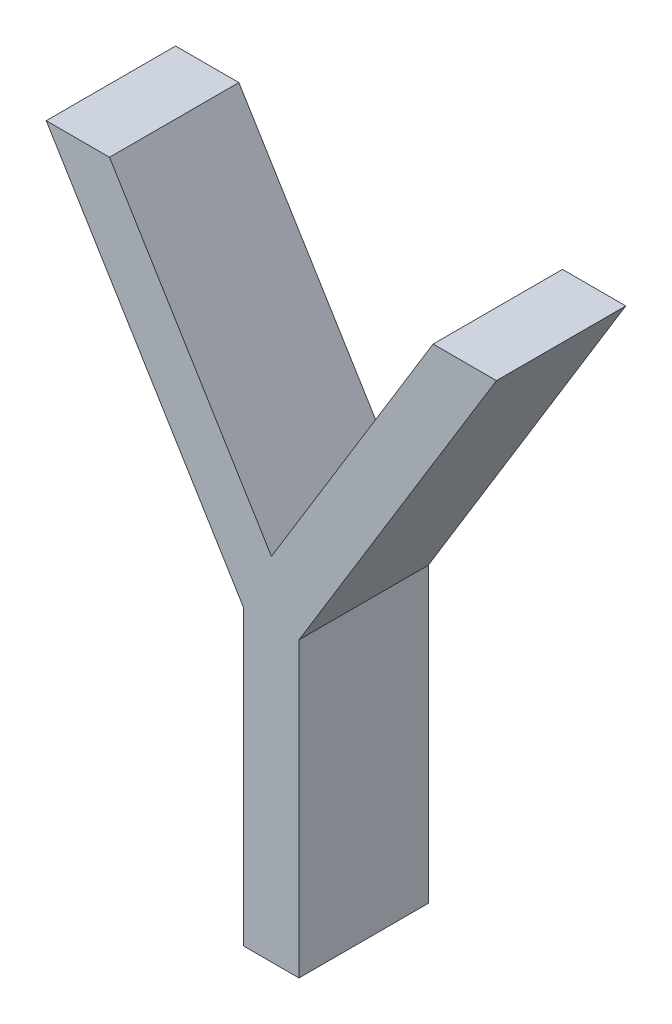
from build123d import *

# Parameters (mm, degrees)
BOSS_EXTRU_1_DEPTH = 2


with BuildPart() as part:
    # Esquisse1 → Boss.-Extru.1 (new, symmetric)
    with BuildSketch(Plane.XY):
        Polygon((186.111025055, 29.374121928), (188.068687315, 29.374121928), (193.075418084, 21.188575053), (198.074516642, 29.374121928), (200.032178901, 29.374121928), (193.92640967, 19.379740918), (193.92640967, 10.324121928), (192.216794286, 10.324121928), (192.216794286, 19.379740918), align=None)
    extrude(amount=BOSS_EXTRU_1_DEPTH, both=True)


solid = part.part
